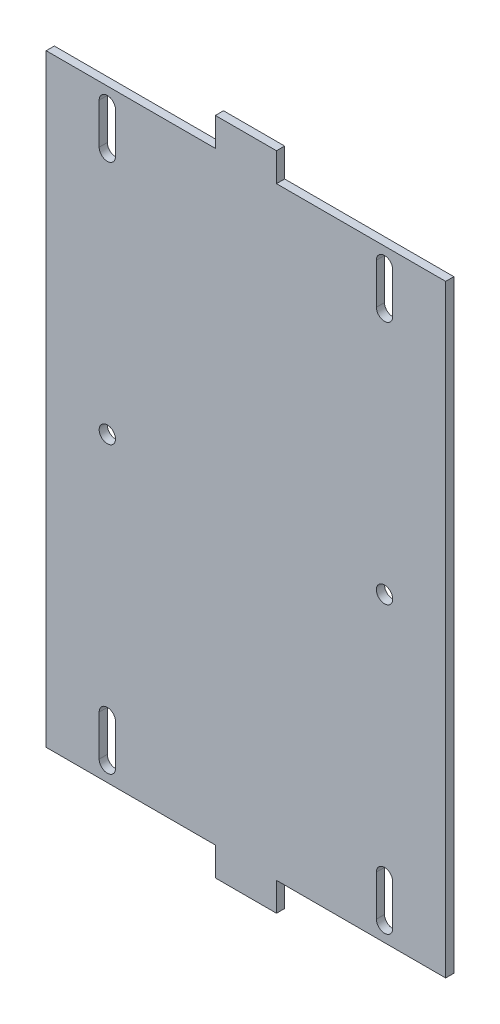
from build123d import *

# Parameters (mm, degrees)
EXTRUSION1_DEPTH                = 2
ENL_V_MAT_EXTRU_1_DEPTH         = 95.68896451
R_P_TITION_LIN_AIRE1_COUNT      = 2
R_P_TITION_LIN_AIRE1_PITCH      = 68
R_P_TITION_LIN_AIRE1_COUNT_DIR2 = 2
R_P_TITION_LIN_AIRE1_PITCH_DIR2 = 130
ESQUISSE3_R                     = 2
ENL_V_MAT_EXTRU_2_DEPTH         = 10
R_P_TITION_LIN_AIRE2_COUNT      = 2
R_P_TITION_LIN_AIRE2_PITCH      = 68


with BuildPart() as part:
    # Esquisse1 → Extrusion1 (new body)
    with BuildSketch(Plane.XY):
        Polygon((-49, -74), (-49, 74), (-7.5, 74), (-7.5, 81), (7.5, 81), (7.5, 74), (49, 74), (49, -74), (7.5, -74), (7.5, -81), (-7.5, -81), (-7.5, -74), align=None)
    extrude(amount=EXTRUSION1_DEPTH)

    # Esquisse2 → Enl_v. mat.-Extru.1 (cut, through all)
    with BuildSketch(Plane.XY.offset(2)):
        with BuildLine():
            Line((-36, 70), (-36, 60))
            ThreePointArc((-36, 60), (-34, 58), (-32, 60))
            Line((-32, 60), (-32, 70))
            ThreePointArc((-32, 70), (-34, 72), (-36, 70))
        make_face()
    enl_v_mat_extru_1 = extrude(amount=-ENL_V_MAT_EXTRU_1_DEPTH, mode=Mode.SUBTRACT)

    # R_p_tition lin_aire1: Enl_v. mat.-Extru.1 2 × 2
    with Locations(*[(i * R_P_TITION_LIN_AIRE1_PITCH, -j * R_P_TITION_LIN_AIRE1_PITCH_DIR2, 0) for i in range(R_P_TITION_LIN_AIRE1_COUNT) for j in range(R_P_TITION_LIN_AIRE1_COUNT_DIR2) if (i, j) != (0, 0)]):
        add(enl_v_mat_extru_1, mode=Mode.SUBTRACT)

    # Esquisse3 → Enl_v. mat.-Extru.2 (cut)
    with BuildSketch(Plane.XY.offset(2)):
        with Locations((-34, 0)):
            Circle(ESQUISSE3_R)
    enl_v_mat_extru_2 = extrude(amount=-ENL_V_MAT_EXTRU_2_DEPTH, mode=Mode.SUBTRACT)

    # R_p_tition lin_aire2: Enl_v. mat.-Extru.2 ×2
    with Locations(*[(i * R_P_TITION_LIN_AIRE2_PITCH, 0, 0) for i in range(1, R_P_TITION_LIN_AIRE2_COUNT)]):
        add(enl_v_mat_extru_2, mode=Mode.SUBTRACT)


solid = part.part
